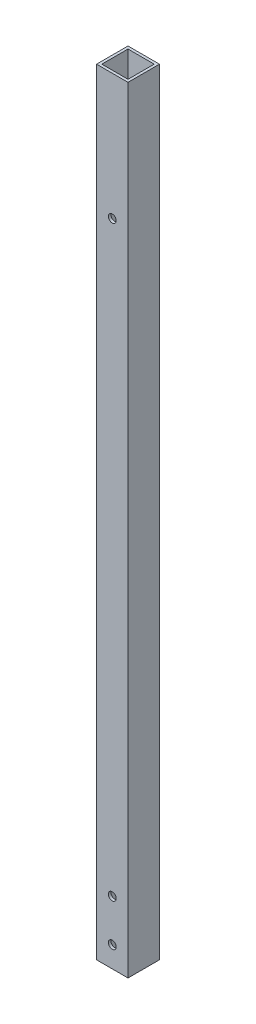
from build123d import *

# Parameters (mm, degrees)
SKETCH1_W           = 38.1
SKETCH1_H           = 38.1
SKETCH1_W_2         = 31.75
SKETCH1_H_2         = 31.75
BOSS_EXTRUDE1_DEPTH = 939.8
SKETCH5_R           = 4.7625
CUT_EXTRUDE3_DEPTH  = 941.764876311


with BuildPart() as part:
    # Sketch1 → Boss-Extrude1 (new body)
    with BuildSketch(Plane(origin=(0, 0, 0), x_dir=(1, 0, 0), z_dir=(0, 1, 0))):
        Rectangle(SKETCH1_W, SKETCH1_H)
        Rectangle(SKETCH1_W_2, SKETCH1_H_2, mode=Mode.SUBTRACT)
    extrude(amount=BOSS_EXTRUDE1_DEPTH)

    # Sketch5 → Cut-Extrude3 (cut, through all)
    with BuildSketch(Plane(origin=(0, 0, -19.05), x_dir=(-1, 0, 0), z_dir=(0, 0, -1))):
        with Locations((0, 25.4)):
            Circle(SKETCH5_R)
        with Locations((0, 76.2)):
            Circle(SKETCH5_R)
        with Locations((0, 787.4)):
            Circle(SKETCH5_R)
    extrude(amount=-CUT_EXTRUDE3_DEPTH, mode=Mode.SUBTRACT)


solid = part.part
